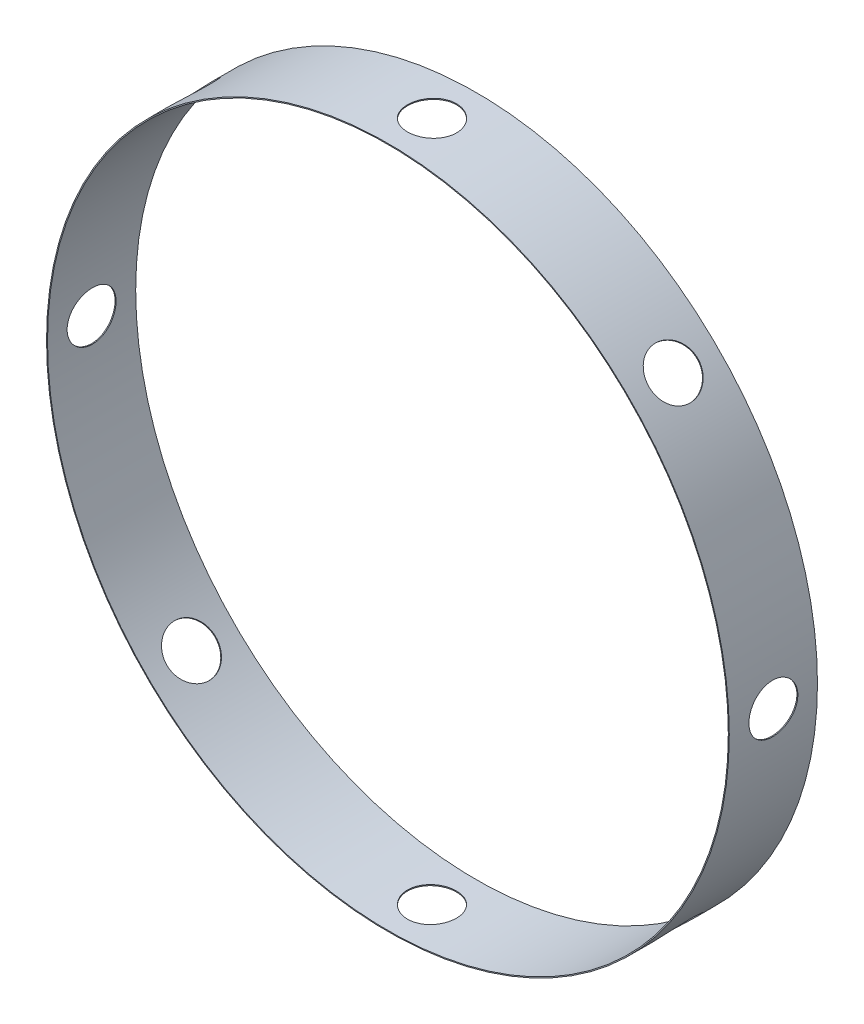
from build123d import *

# Parameters (mm, degrees)
SKETCH1_R           = 177.154
SKETCH1_R_2         = 176.646
EXTRUDE_THIN1_DEPTH = 45.761999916
SKETCH5_R           = 12.7
CUT_EXTRUDE4_DEPTH  = 200
CIRPATTERN3_COUNT   = 8


with BuildPart() as part:
    # Sketch1 → Extrude-Thin1 (new body)
    with BuildSketch(Plane.XY):
        Circle(SKETCH1_R)
        Circle(SKETCH1_R_2, mode=Mode.SUBTRACT)
    extrude(amount=EXTRUDE_THIN1_DEPTH)

    # Sketch5 → Cut-Extrude4 (cut)
    with BuildSketch(Plane(origin=(0, 0, 0), x_dir=(1, 0, 0), z_dir=(0, 1, 0))):
        with Locations(Location((0, -22.880999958, 0), (0, 0, 270))):
            Circle(SKETCH5_R)
    cut_extrude4 = extrude(amount=-CUT_EXTRUDE4_DEPTH, mode=Mode.SUBTRACT)

    # CirPattern3: Cut-Extrude4 ×8 about axis
    cirpattern3_axis = Axis((0, 0, 45.761999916), (0, 0, -1))
    for i in range(1, CIRPATTERN3_COUNT):
        add(cut_extrude4.rotate(cirpattern3_axis, i * 360 / CIRPATTERN3_COUNT), mode=Mode.SUBTRACT)


solid = part.part
